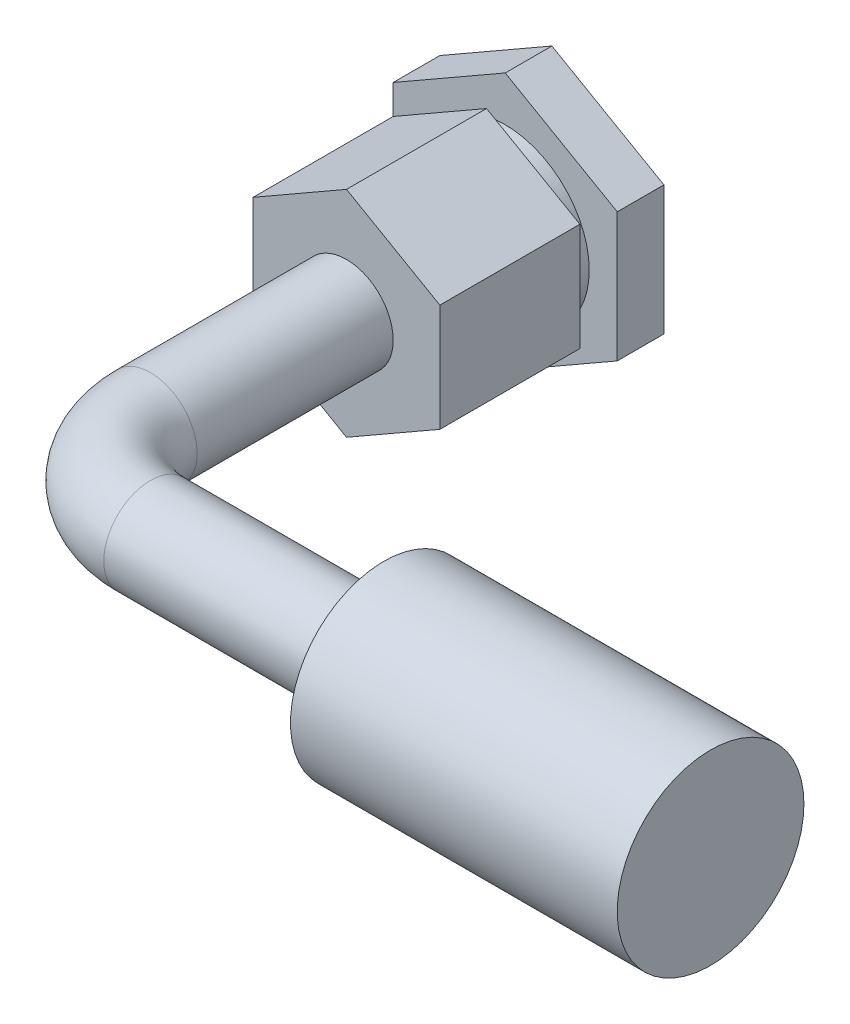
from build123d import *

# Parameters (mm, degrees)
ESQUISSE1_R      = 8
EXTRUSION1_DEPTH = 5
EXTRUSION2_START = -2
ESQUISSE2_R      = 9
EXTRUSION2_DEPTH = 9
EXTRUSION3_DEPTH = 15
ESQUISSE4_R      = 5
ESQUISSE4_R_2    = 4
ESQUISSE6_R      = 10
EXTRUSION4_DEPTH = 35


with BuildPart() as part:
    # Esquisse1 → Extrusion1 (new body)
    with BuildSketch(Plane.XY):
        Polygon((0, 13.8), (12, 6.916944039), (12, -6.916944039), (0, -13.8), (-12, -6.916944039), (-12, 6.916944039), align=None)
        Circle(ESQUISSE1_R, mode=Mode.SUBTRACT)
    extrude(amount=EXTRUSION1_DEPTH)

    # Esquisse2 → Extrusion2 (add)
    with BuildSketch(Plane.XY.offset(EXTRUSION2_START)):
        Circle(ESQUISSE2_R)
    extrude(amount=EXTRUSION2_DEPTH)

    # Esquisse3 → Extrusion3 (add)
    with BuildSketch(Plane.XY.offset(7)):
        Polygon((0, 11.5), (10, 5.764120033), (10, -5.764120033), (0, -11.5), (-10, -5.764120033), (-10, 5.764120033), align=None)
    extrude(amount=EXTRUSION3_DEPTH)

    # Balayage-Mince1: sweep along a path in Esquisse5
    with BuildLine(Plane(origin=(0, 0, 0), x_dir=(1, 0, 0), z_dir=(0, 1, 0))) as balayage_mince1_path:
        Line((0, -22), (0, -43))
        ThreePointArc((0, -43), (2.928932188, -50.071067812), (10, -53))
        Line((10, -53), (35, -53))
    # Esquisse4 → Balayage-Mince1 (sweep)
    with BuildSketch(Plane.XY.offset(22)):
        Circle(ESQUISSE4_R)
        Circle(ESQUISSE4_R_2, mode=Mode.SUBTRACT)
    sweep(path=balayage_mince1_path.line)

    # Esquisse6 → Extrusion4 (add)
    with BuildSketch(Plane(origin=(35, 0, 0), x_dir=(0, 0, -1), z_dir=(1, 0, 0))):
        with Locations((-53, 0)):
            Circle(ESQUISSE6_R)
    extrude(amount=EXTRUSION4_DEPTH)


solid = part.part
